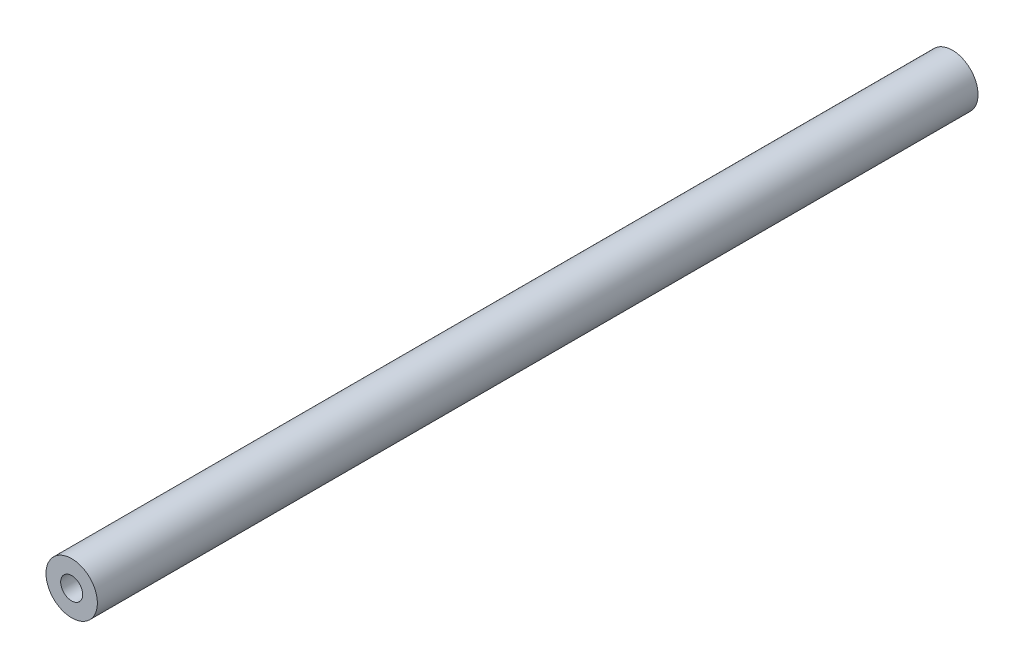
from build123d import *

# Parameters (mm, degrees)
GK_W = 120
GK_H = 2


with BuildPart() as part:
    # GK → Rotation_GK (revolve)
    with BuildSketch(Plane(origin=(0, 0, 0), x_dir=(0, 0, -1), z_dir=(1, 0, 0)), mode=Mode.PRIVATE) as rotation_gk_sk:
        with Locations((-60, 2.5)):
            Rectangle(GK_W, GK_H)
    revolve(rotation_gk_sk.sketch.rotate(Axis((0, 0, -5.303070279), (0, 0, 1)), 90), axis=Axis((0, 0, -5.303070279), (0, 0, 1)))


solid = part.part
